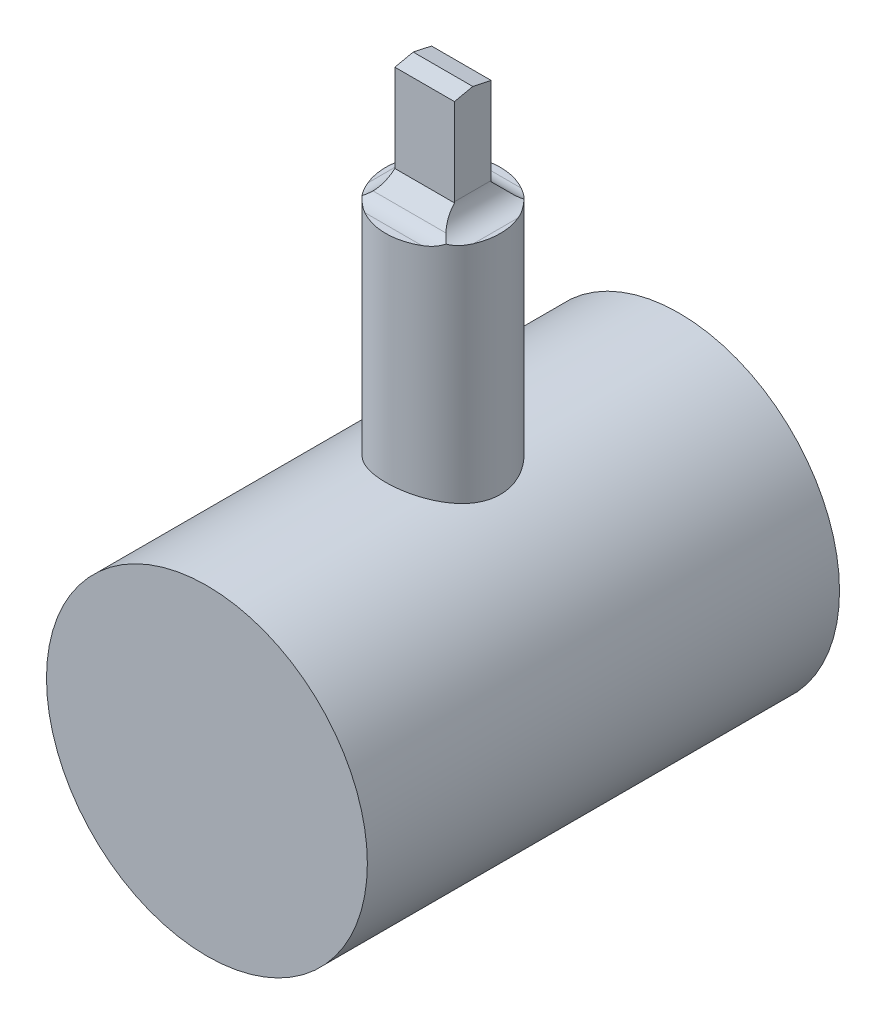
ISO-10303-21;
HEADER;
FILE_DESCRIPTION(('STEP AP214'),'2;1');
FILE_NAME('part.step','',(''),(''),'','','');
FILE_SCHEMA(('AUTOMOTIVE_DESIGN { 1 0 10303 214 1 1 1 1 }'));
ENDSEC;
DATA;
#1=APPLICATION_CONTEXT('core data for automotive mechanical design processes');
#2=APPLICATION_PROTOCOL_DEFINITION('international standard','automotive_design',2000,#1);
#3=PRODUCT_CONTEXT('',#1,'mechanical');
#4=PRODUCT('Part','Part','',(#3));
#5=PRODUCT_RELATED_PRODUCT_CATEGORY('part','',(#4));
#6=PRODUCT_DEFINITION_FORMATION('','',#4);
#7=PRODUCT_DEFINITION_CONTEXT('part definition',#1,'design');
#8=PRODUCT_DEFINITION('design','',#6,#7);
#9=PRODUCT_DEFINITION_SHAPE('','',#8);
#10=(LENGTH_UNIT() NAMED_UNIT(*) SI_UNIT(.MILLI.,.METRE.));
#11=(NAMED_UNIT(*) PLANE_ANGLE_UNIT() SI_UNIT($,.RADIAN.));
#12=(NAMED_UNIT(*) SI_UNIT($,.STERADIAN.) SOLID_ANGLE_UNIT());
#13=UNCERTAINTY_MEASURE_WITH_UNIT(LENGTH_MEASURE(1.E-05),#10,'distance_accuracy_value','');
#14=(GEOMETRIC_REPRESENTATION_CONTEXT(3) GLOBAL_UNCERTAINTY_ASSIGNED_CONTEXT((#13)) GLOBAL_UNIT_ASSIGNED_CONTEXT((#10,
#11,#12)) REPRESENTATION_CONTEXT('',''));
#15=CARTESIAN_POINT('',(0.,0.,0.));
#16=DIRECTION('',(0.,0.,1.));
#17=DIRECTION('',(1.,0.,0.));
#18=AXIS2_PLACEMENT_3D('',#15,#16,#17);
#19=CARTESIAN_POINT('',(-6.7818,10.417713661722,1.11388633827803));
#20=DIRECTION('',(0.,-1.,0.));
#21=DIRECTION('',(0.,0.,-1.));
#22=AXIS2_PLACEMENT_3D('',#19,#20,#21);
#23=PLANE('',#22);
#24=CARTESIAN_POINT('',(0.,10.417713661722,0.));
#25=DIRECTION('',(0.,-1.,0.));
#26=DIRECTION('',(0.,0.,-1.));
#27=AXIS2_PLACEMENT_3D('',#24,#25,#26);
#28=CIRCLE('',#27,1.5875);
#29=CARTESIAN_POINT('',(1.4605,10.417713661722,-0.622170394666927));
#30=VERTEX_POINT('',#29);
#31=CARTESIAN_POINT('',(1.4605,10.417713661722,0.622170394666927));
#32=VERTEX_POINT('',#31);
#33=EDGE_CURVE('E341',#30,#32,#28,.T.);
#34=ORIENTED_EDGE('',*,*,#33,.F.);
#35=DIRECTION('',(0.,0.,1.));
#36=VECTOR('',#35,1.);
#37=CARTESIAN_POINT('',(1.4605,10.417713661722,1.11388633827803));
#38=LINE('',#37,#36);
#39=EDGE_CURVE('E334',#30,#32,#38,.T.);
#40=ORIENTED_EDGE('',*,*,#39,.T.);
#41=EDGE_LOOP('',(#34,#40));
#42=FACE_BOUND('',#41,.T.);
#43=ADVANCED_FACE('F32',(#42),#23,.F.);
#44=CARTESIAN_POINT('',(-0.790107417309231,10.417713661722,-1.37691195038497));
#45=VERTEX_POINT('',#44);
#46=CARTESIAN_POINT('',(0.790107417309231,10.417713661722,-1.37691195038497));
#47=VERTEX_POINT('',#46);
#48=EDGE_CURVE('E194',#45,#47,#28,.T.);
#49=ORIENTED_EDGE('',*,*,#48,.F.);
#50=DIRECTION('',(1.,0.,0.));
#51=VECTOR('',#50,1.);
#52=CARTESIAN_POINT('',(0.8255,10.417713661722,-1.37691195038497));
#53=LINE('',#52,#51);
#54=EDGE_CURVE('E337',#45,#47,#53,.T.);
#55=ORIENTED_EDGE('',*,*,#54,.T.);
#56=EDGE_LOOP('',(#49,#55));
#57=FACE_BOUND('',#56,.T.);
#58=ADVANCED_FACE('F354',(#57),#23,.F.);
#59=CARTESIAN_POINT('',(0.790107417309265,10.417713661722,1.37691195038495));
#60=VERTEX_POINT('',#59);
#61=CARTESIAN_POINT('',(-0.790107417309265,10.417713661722,1.37691195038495));
#62=VERTEX_POINT('',#61);
#63=EDGE_CURVE('E342',#60,#62,#28,.T.);
#64=ORIENTED_EDGE('',*,*,#63,.F.);
#65=DIRECTION('',(1.,0.,0.));
#66=VECTOR('',#65,1.);
#67=CARTESIAN_POINT('',(-0.8255,10.417713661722,1.37691195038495));
#68=LINE('',#67,#66);
#69=EDGE_CURVE('E339',#60,#62,#68,.F.);
#70=ORIENTED_EDGE('',*,*,#69,.T.);
#71=EDGE_LOOP('',(#64,#70));
#72=FACE_BOUND('',#71,.T.);
#73=ADVANCED_FACE('F356',(#72),#23,.F.);
#74=CARTESIAN_POINT('',(0.,0.,6.5405));
#75=DIRECTION('',(0.,0.,-1.));
#76=DIRECTION('',(-1.,0.,0.));
#77=AXIS2_PLACEMENT_3D('',#74,#75,#76);
#78=CYLINDRICAL_SURFACE('',#77,4.445);
#79=CARTESIAN_POINT('',(0.,0.,-6.5405));
#80=DIRECTION('',(0.,0.,1.));
#81=DIRECTION('',(1.,0.,0.));
#82=AXIS2_PLACEMENT_3D('',#79,#80,#81);
#83=CIRCLE('',#82,4.445);
#84=CARTESIAN_POINT('',(4.445,0.,-6.5405));
#85=VERTEX_POINT('',#84);
#86=EDGE_CURVE('E171',#85,#85,#83,.T.);
#87=ORIENTED_EDGE('',*,*,#86,.T.);
#88=EDGE_LOOP('',(#87));
#89=FACE_BOUND('',#88,.T.);
#90=CARTESIAN_POINT('',(0.,0.,6.5405));
#91=DIRECTION('',(0.,0.,1.));
#92=DIRECTION('',(1.,0.,0.));
#93=AXIS2_PLACEMENT_3D('',#90,#91,#92);
#94=CIRCLE('',#93,4.445);
#95=CARTESIAN_POINT('',(4.445,0.,6.5405));
#96=VERTEX_POINT('',#95);
#97=EDGE_CURVE('E181',#96,#96,#94,.T.);
#98=ORIENTED_EDGE('',*,*,#97,.F.);
#99=EDGE_LOOP('',(#98));
#100=FACE_BOUND('',#99,.T.);
#101=CARTESIAN_POINT('',(0.,4.445,-1.5875));
#102=CARTESIAN_POINT('',(-0.0862582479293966,4.44500128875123,-1.58750179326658));
#103=CARTESIAN_POINT('',(-0.172503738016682,4.44246670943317,-1.58044720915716));
#104=CARTESIAN_POINT('',(-0.34243320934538,4.43260737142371,-1.55251703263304));
#105=CARTESIAN_POINT('',(-0.426117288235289,4.4252827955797,-1.53164196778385));
#106=CARTESIAN_POINT('',(-0.588449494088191,4.40663399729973,-1.47689243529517));
#107=CARTESIAN_POINT('',(-0.667106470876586,4.3953170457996,-1.44304158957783));
#108=CARTESIAN_POINT('',(-0.817623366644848,4.36982284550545,-1.36341566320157));
#109=CARTESIAN_POINT('',(-0.889481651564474,4.35564491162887,-1.31763772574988));
#110=CARTESIAN_POINT('',(-1.02716839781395,4.32528584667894,-1.21358461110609));
#111=CARTESIAN_POINT('',(-1.09269539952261,4.30905175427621,-1.15492610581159));
#112=CARTESIAN_POINT('',(-1.21321956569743,4.27668386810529,-1.02759105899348));
#113=CARTESIAN_POINT('',(-1.26821392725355,4.26055010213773,-0.958911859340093));
#114=CARTESIAN_POINT('',(-1.3679407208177,4.22960844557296,-0.810642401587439));
#115=CARTESIAN_POINT('',(-1.41226241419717,4.21486398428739,-0.730761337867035));
#116=CARTESIAN_POINT('',(-1.48671008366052,4.18918613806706,-0.564068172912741));
#117=CARTESIAN_POINT('',(-1.51684113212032,4.17825139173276,-0.477258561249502));
#118=CARTESIAN_POINT('',(-1.56088797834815,4.16199344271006,-0.302626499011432));
#119=CARTESIAN_POINT('',(-1.57537479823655,4.15647335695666,-0.214966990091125));
#120=CARTESIAN_POINT('',(-1.5895075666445,4.15109064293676,-0.0383008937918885));
#121=CARTESIAN_POINT('',(-1.58915893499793,4.15122594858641,0.050705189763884));
#122=CARTESIAN_POINT('',(-1.5740702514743,4.15696773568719,0.222475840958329));
#123=CARTESIAN_POINT('',(-1.56010077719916,4.1622812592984,0.305319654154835));
#124=CARTESIAN_POINT('',(-1.51943340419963,4.17729722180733,0.467399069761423));
#125=CARTESIAN_POINT('',(-1.4927337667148,4.18700026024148,0.546634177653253));
#126=CARTESIAN_POINT('',(-1.42690574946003,4.20989233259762,0.700896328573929));
#127=CARTESIAN_POINT('',(-1.38756514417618,4.22314019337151,0.775823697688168));
#128=CARTESIAN_POINT('',(-1.29771948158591,4.25160738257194,0.918245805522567));
#129=CARTESIAN_POINT('',(-1.24721083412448,4.26682734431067,0.985738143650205));
#130=CARTESIAN_POINT('',(-1.13285999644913,4.29864836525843,1.11566934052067));
#131=CARTESIAN_POINT('',(-1.06839595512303,4.31527726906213,1.17755534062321));
#132=CARTESIAN_POINT('',(-0.929806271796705,4.34724475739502,1.28979401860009));
#133=CARTESIAN_POINT('',(-0.855679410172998,4.36258317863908,1.34014523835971));
#134=CARTESIAN_POINT('',(-0.698563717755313,4.39049794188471,1.42842018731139));
#135=CARTESIAN_POINT('',(-0.615473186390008,4.40303622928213,1.46617578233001));
#136=CARTESIAN_POINT('',(-0.443562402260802,4.4236587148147,1.52699454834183));
#137=CARTESIAN_POINT('',(-0.354744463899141,4.43174469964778,1.55006361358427));
#138=CARTESIAN_POINT('',(-0.178565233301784,4.44224538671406,1.57982866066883));
#139=CARTESIAN_POINT('',(-0.0913451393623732,4.44491811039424,1.58727021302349));
#140=CARTESIAN_POINT('',(0.0831274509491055,4.44507809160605,1.58771915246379));
#141=CARTESIAN_POINT('',(0.170379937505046,4.4425663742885,1.58072939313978));
#142=CARTESIAN_POINT('',(0.339324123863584,4.43281022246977,1.5530918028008));
#143=CARTESIAN_POINT('',(0.421103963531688,4.42573040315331,1.53291873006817));
#144=CARTESIAN_POINT('',(0.580072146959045,4.40771436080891,1.4800982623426));
#145=CARTESIAN_POINT('',(0.657259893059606,4.39677763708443,1.44744924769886));
#146=CARTESIAN_POINT('',(0.807286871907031,4.37175744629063,1.36959412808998));
#147=CARTESIAN_POINT('',(0.879942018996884,4.35759391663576,1.3240597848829));
#148=CARTESIAN_POINT('',(1.0168123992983,4.32770531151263,1.22210354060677));
#149=CARTESIAN_POINT('',(1.08102472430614,4.31197970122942,1.16567790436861));
#150=CARTESIAN_POINT('',(1.20270455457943,4.27968436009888,1.04004768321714));
#151=CARTESIAN_POINT('',(1.25964113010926,4.26311364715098,0.970327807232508));
#152=CARTESIAN_POINT('',(1.36109408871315,4.23181701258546,0.821981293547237));
#153=CARTESIAN_POINT('',(1.40560986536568,4.21709118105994,0.743354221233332));
#154=CARTESIAN_POINT('',(1.48087515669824,4.19125611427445,0.579078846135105));
#155=CARTESIAN_POINT('',(1.51160994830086,4.1801507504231,0.493423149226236));
#156=CARTESIAN_POINT('',(1.55804501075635,4.16306915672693,0.317652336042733));
#157=CARTESIAN_POINT('',(1.573753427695,4.15709014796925,0.227539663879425));
#158=CARTESIAN_POINT('',(1.58900022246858,4.15128453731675,0.0511044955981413));
#159=CARTESIAN_POINT('',(1.58943311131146,4.15111759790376,-0.0351302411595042));
#160=CARTESIAN_POINT('',(1.57636867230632,4.15609607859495,-0.206373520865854));
#161=CARTESIAN_POINT('',(1.56287242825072,4.16124108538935,-0.291382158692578));
#162=CARTESIAN_POINT('',(1.52300309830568,4.17599304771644,-0.455612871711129));
#163=CARTESIAN_POINT('',(1.49696145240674,4.18548486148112,-0.534926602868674));
#164=CARTESIAN_POINT('',(1.43302129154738,4.20780419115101,-0.688113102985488));
#165=CARTESIAN_POINT('',(1.39511992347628,4.22063250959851,-0.761984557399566));
#166=CARTESIAN_POINT('',(1.30638748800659,4.24895791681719,-0.906097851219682));
#167=CARTESIAN_POINT('',(1.25501635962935,4.26455459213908,-0.975987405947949));
#168=CARTESIAN_POINT('',(1.14167198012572,4.29628561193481,-1.10644146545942));
#169=CARTESIAN_POINT('',(1.07969552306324,4.31242011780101,-1.16700313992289));
#170=CARTESIAN_POINT('',(0.943395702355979,4.34432357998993,-1.27998340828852));
#171=CARTESIAN_POINT('',(0.868627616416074,4.36003933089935,-1.33188268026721));
#172=CARTESIAN_POINT('',(0.710889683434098,4.38851626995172,-1.42234136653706));
#173=CARTESIAN_POINT('',(0.627920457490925,4.40127768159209,-1.46090179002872));
#174=CARTESIAN_POINT('',(0.455705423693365,4.42243213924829,-1.52345409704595));
#175=CARTESIAN_POINT('',(0.366434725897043,4.43080661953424,-1.54738413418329));
#176=CARTESIAN_POINT('',(0.184770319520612,4.4420887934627,-1.57940303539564));
#177=CARTESIAN_POINT('',(0.09237784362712,4.44499861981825,-1.58749807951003));
#178=CARTESIAN_POINT('',(0.,4.445,-1.5875));
#179=B_SPLINE_CURVE_WITH_KNOTS('',3,(#101,#102,#103,#104,#105,#106,#107,#108,#109,#110,#111,
#112,#113,#114,#115,#116,#117,#118,#119,#120,#121,#122,#123,#124,#125,#126,#127,#128,#129,#130,
#131,#132,#133,#134,#135,#136,#137,#138,#139,#140,#141,#142,#143,#144,#145,#146,#147,#148,#149,
#150,#151,#152,#153,#154,#155,#156,#157,#158,#159,#160,#161,#162,#163,#164,#165,#166,#167,#168,
#169,#170,#171,#172,#173,#174,#175,#176,#177,#178),.UNSPECIFIED.,.T.,.F.,(4,2,2,2,2,2,2,2,2,2,2,
2,2,2,2,2,2,2,2,2,2,2,2,2,2,2,2,2,2,2,2,2,2,2,2,2,2,2,4),(0.,0.258434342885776,
0.516858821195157,0.774815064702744,1.03283315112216,1.29993753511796,1.56711290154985,
1.84333900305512,2.11946629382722,2.3851334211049,2.65070349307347,2.90207221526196,
3.15347528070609,3.40934135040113,3.66528979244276,3.93672474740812,4.20819399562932,
4.48315413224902,4.75800384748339,5.01941166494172,5.28076779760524,5.53319522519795,
5.78565543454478,6.04523719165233,6.30490813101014,6.5782087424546,6.85152269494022,
7.12512795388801,7.39858480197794,7.65600011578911,7.91339540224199,8.16433522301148,
8.41533545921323,8.67856687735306,8.94187801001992,9.21761831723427,9.49333775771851,
9.77021481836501,10.046983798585),.UNSPECIFIED.);
#180=CARTESIAN_POINT('',(0.,4.445,-1.5875));
#181=VERTEX_POINT('',#180);
#182=EDGE_CURVE('E184',#181,#181,#179,.T.);
#183=ORIENTED_EDGE('',*,*,#182,.F.);
#184=EDGE_LOOP('',(#183));
#185=FACE_BOUND('',#184,.T.);
#186=ADVANCED_FACE('F196',(#89,#100,#185),#78,.T.);
#187=CARTESIAN_POINT('',(0.,0.,6.5405));
#188=DIRECTION('',(0.,0.,1.));
#189=DIRECTION('',(1.,0.,0.));
#190=AXIS2_PLACEMENT_3D('',#187,#188,#189);
#191=PLANE('',#190);
#192=ORIENTED_EDGE('',*,*,#97,.T.);
#193=EDGE_LOOP('',(#192));
#194=FACE_BOUND('',#193,.T.);
#195=ADVANCED_FACE('F209',(#194),#191,.T.);
#196=CARTESIAN_POINT('',(0.,0.,-6.5405));
#197=DIRECTION('',(0.,0.,1.));
#198=DIRECTION('',(1.,0.,0.));
#199=AXIS2_PLACEMENT_3D('',#196,#197,#198);
#200=PLANE('',#199);
#201=ORIENTED_EDGE('',*,*,#86,.F.);
#202=EDGE_LOOP('',(#201));
#203=FACE_BOUND('',#202,.T.);
#204=ADVANCED_FACE('F205',(#203),#200,.F.);
#205=CARTESIAN_POINT('',(0.,13.5636,0.));
#206=DIRECTION('',(0.,-1.,0.));
#207=DIRECTION('',(0.,0.,-1.));
#208=AXIS2_PLACEMENT_3D('',#205,#206,#207);
#209=CYLINDRICAL_SURFACE('',#208,1.5875);
#210=ORIENTED_EDGE('',*,*,#48,.T.);
#211=CARTESIAN_POINT('',(0.790107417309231,10.417713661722,-1.37691195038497));
#212=CARTESIAN_POINT('',(0.813546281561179,10.4177180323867,-1.36346117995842));
#213=CARTESIAN_POINT('',(0.836635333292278,10.4181414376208,-1.34941612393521));
#214=CARTESIAN_POINT('',(0.88207307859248,10.4200829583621,-1.32016556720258));
#215=CARTESIAN_POINT('',(0.904420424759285,10.421602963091,-1.30495810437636));
#216=CARTESIAN_POINT('',(0.96925911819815,10.4281014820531,-1.2583610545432));
#217=CARTESIAN_POINT('',(1.01052741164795,10.4349985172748,-1.22543237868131));
#218=CARTESIAN_POINT('',(1.06976923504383,10.4509761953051,-1.17323565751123));
#219=CARTESIAN_POINT('',(1.08940066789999,10.4574113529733,-1.15501416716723));
#220=CARTESIAN_POINT('',(1.12747537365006,10.4725949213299,-1.11788833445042));
#221=CARTESIAN_POINT('',(1.14590453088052,10.4813661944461,-1.09897893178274));
#222=CARTESIAN_POINT('',(1.16354773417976,10.4914255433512,-1.07995968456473));
#223=B_SPLINE_CURVE_WITH_KNOTS('',3,(#211,#212,#213,#214,#215,#216,#217,#218,#219,#220,#221,
#222),.UNSPECIFIED.,.F.,.F.,(4,2,2,2,2,4),(0.,0.0810400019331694,0.162219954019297,
0.321211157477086,0.403737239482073,0.487102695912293),.UNSPECIFIED.);
#224=CARTESIAN_POINT('',(1.16354773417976,10.4914255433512,-1.07995968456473));
#225=VERTEX_POINT('',#224);
#226=EDGE_CURVE('E233',#47,#225,#223,.T.);
#227=ORIENTED_EDGE('',*,*,#226,.T.);
#228=CARTESIAN_POINT('',(1.16354773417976,10.4914255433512,-1.07995968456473));
#229=CARTESIAN_POINT('',(1.18099122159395,10.48220141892,-1.06117481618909));
#230=CARTESIAN_POINT('',(1.1982249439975,10.4741186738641,-1.0416850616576));
#231=CARTESIAN_POINT('',(1.23201637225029,10.4599607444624,-1.00148702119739));
#232=CARTESIAN_POINT('',(1.24857516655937,10.4538822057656,-0.980780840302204));
#233=CARTESIAN_POINT('',(1.29641225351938,10.4383735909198,-0.917724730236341));
#234=CARTESIAN_POINT('',(1.32643909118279,10.4313871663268,-0.873808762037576));
#235=CARTESIAN_POINT('',(1.37426699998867,10.423267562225,-0.795630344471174));
#236=CARTESIAN_POINT('',(1.39313877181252,10.4210438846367,-0.762102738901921));
#237=CARTESIAN_POINT('',(1.42863675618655,10.4182655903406,-0.693303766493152));
#238=CARTESIAN_POINT('',(1.44523381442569,10.4177309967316,-0.658016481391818));
#239=CARTESIAN_POINT('',(1.4605,10.417713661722,-0.622170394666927));
#240=B_SPLINE_CURVE_WITH_KNOTS('',3,(#228,#229,#230,#231,#232,#233,#234,#235,#236,#237,#238,
#239),.UNSPECIFIED.,.F.,.F.,(4,2,2,2,2,4),(0.,0.0816434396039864,0.163149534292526,
0.323477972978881,0.438970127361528,0.555826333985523),.UNSPECIFIED.);
#241=EDGE_CURVE('E225',#225,#30,#240,.T.);
#242=ORIENTED_EDGE('',*,*,#241,.T.);
#243=ORIENTED_EDGE('',*,*,#33,.T.);
#244=CARTESIAN_POINT('',(1.4605,10.417713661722,0.622170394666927));
#245=CARTESIAN_POINT('',(1.44598997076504,10.4177269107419,0.656250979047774));
#246=CARTESIAN_POINT('',(1.4302636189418,10.4182123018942,0.689840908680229));
#247=CARTESIAN_POINT('',(1.39646726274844,10.4207185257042,0.755917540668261));
#248=CARTESIAN_POINT('',(1.37838859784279,10.4227451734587,0.788399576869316));
#249=CARTESIAN_POINT('',(1.34059167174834,10.4288526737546,0.851043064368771));
#250=CARTESIAN_POINT('',(1.32092891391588,10.432878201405,0.881243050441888));
#251=CARTESIAN_POINT('',(1.27986494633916,10.44357880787,0.939881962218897));
#252=CARTESIAN_POINT('',(1.25846732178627,10.4502485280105,0.96832431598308));
#253=CARTESIAN_POINT('',(1.22462317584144,10.4630142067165,1.01035043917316));
#254=CARTESIAN_POINT('',(1.21265210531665,10.4679291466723,1.02468183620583));
#255=CARTESIAN_POINT('',(1.18833781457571,10.478839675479,1.05278595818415));
#256=CARTESIAN_POINT('',(1.17599259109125,10.4848425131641,1.06655412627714));
#257=CARTESIAN_POINT('',(1.16354773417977,10.4914255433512,1.07995968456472));
#258=B_SPLINE_CURVE_WITH_KNOTS('',3,(#244,#245,#246,#247,#248,#249,#250,#251,#252,#253,#254,
#255,#256,#257),.UNSPECIFIED.,.F.,.F.,(4,2,2,2,2,2,4),(0.,0.111136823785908,0.222695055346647,
0.331324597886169,0.439735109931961,0.497625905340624,0.555917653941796),.UNSPECIFIED.);
#259=CARTESIAN_POINT('',(1.16354773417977,10.4914255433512,1.07995968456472));
#260=VERTEX_POINT('',#259);
#261=EDGE_CURVE('E216',#32,#260,#258,.T.);
#262=ORIENTED_EDGE('',*,*,#261,.T.);
#263=CARTESIAN_POINT('',(1.16354773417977,10.4914255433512,1.07995968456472));
#264=CARTESIAN_POINT('',(1.14620557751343,10.4815379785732,1.09865374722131));
#265=CARTESIAN_POINT('',(1.12810408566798,10.4728947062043,1.11724259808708));
#266=CARTESIAN_POINT('',(1.09057086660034,10.4578315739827,1.15390391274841));
#267=CARTESIAN_POINT('',(1.07114163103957,10.4514076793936,1.17197725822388));
#268=CARTESIAN_POINT('',(1.01174854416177,10.4352141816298,1.22444722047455));
#269=CARTESIAN_POINT('',(0.970059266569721,10.4281967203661,1.25776819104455));
#270=CARTESIAN_POINT('',(0.904825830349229,10.4216360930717,1.30467569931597));
#271=CARTESIAN_POINT('',(0.882542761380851,10.4201119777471,1.31985024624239));
#272=CARTESIAN_POINT('',(0.836998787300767,10.4181482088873,1.3491948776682));
#273=CARTESIAN_POINT('',(0.813731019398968,10.417718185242,1.3633549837));
#274=CARTESIAN_POINT('',(0.790107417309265,10.417713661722,1.37691195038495));
#275=B_SPLINE_CURVE_WITH_KNOTS('',3,(#263,#264,#265,#266,#267,#268,#269,#270,#271,#272,#273,
#274),.UNSPECIFIED.,.F.,.F.,(4,2,2,2,2,4),(0.,0.0819448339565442,0.163739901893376,
0.324455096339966,0.405422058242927,0.487099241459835),.UNSPECIFIED.);
#276=EDGE_CURVE('E247',#260,#60,#275,.T.);
#277=ORIENTED_EDGE('',*,*,#276,.T.);
#278=ORIENTED_EDGE('',*,*,#63,.T.);
#279=CARTESIAN_POINT('',(-0.790107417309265,10.417713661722,1.37691195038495));
#280=CARTESIAN_POINT('',(-0.813546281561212,10.4177180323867,1.3634611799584));
#281=CARTESIAN_POINT('',(-0.836635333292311,10.4181414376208,1.34941612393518));
#282=CARTESIAN_POINT('',(-0.882073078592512,10.4200829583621,1.32016556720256));
#283=CARTESIAN_POINT('',(-0.904420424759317,10.421602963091,1.30495810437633));
#284=CARTESIAN_POINT('',(-0.969259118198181,10.4281014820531,1.25836105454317));
#285=CARTESIAN_POINT('',(-1.01052741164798,10.4349985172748,1.22543237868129));
#286=CARTESIAN_POINT('',(-1.06976923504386,10.4509761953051,1.17323565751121));
#287=CARTESIAN_POINT('',(-1.08940066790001,10.4574113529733,1.15501416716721));
#288=CARTESIAN_POINT('',(-1.12747537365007,10.4725949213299,1.1178883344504));
#289=CARTESIAN_POINT('',(-1.14590453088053,10.4813661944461,1.09897893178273));
#290=CARTESIAN_POINT('',(-1.16354773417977,10.4914255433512,1.07995968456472));
#291=B_SPLINE_CURVE_WITH_KNOTS('',3,(#279,#280,#281,#282,#283,#284,#285,#286,#287,#288,#289,
#290),.UNSPECIFIED.,.F.,.F.,(4,2,2,2,2,4),(0.,0.0810400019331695,0.162219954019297,
0.321211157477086,0.40373723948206,0.487102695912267),.UNSPECIFIED.);
#292=CARTESIAN_POINT('',(-1.16354773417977,10.4914255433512,1.07995968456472));
#293=VERTEX_POINT('',#292);
#294=EDGE_CURVE('E254',#62,#293,#291,.T.);
#295=ORIENTED_EDGE('',*,*,#294,.T.);
#296=CARTESIAN_POINT('',(-1.16354773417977,10.4914255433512,1.07995968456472));
#297=CARTESIAN_POINT('',(-1.18099122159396,10.48220141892,1.06117481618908));
#298=CARTESIAN_POINT('',(-1.19822494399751,10.4741186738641,1.04168506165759));
#299=CARTESIAN_POINT('',(-1.2320163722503,10.4599607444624,1.00148702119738));
#300=CARTESIAN_POINT('',(-1.24857516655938,10.4538822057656,0.980780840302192));
#301=CARTESIAN_POINT('',(-1.29641225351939,10.4383735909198,0.917724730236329));
#302=CARTESIAN_POINT('',(-1.3264390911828,10.4313871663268,0.873808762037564));
#303=CARTESIAN_POINT('',(-1.37426699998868,10.423267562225,0.795630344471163));
#304=CARTESIAN_POINT('',(-1.39313877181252,10.4210438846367,0.762102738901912));
#305=CARTESIAN_POINT('',(-1.42863675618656,10.4182655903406,0.693303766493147));
#306=CARTESIAN_POINT('',(-1.44523381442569,10.4177309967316,0.658016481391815));
#307=CARTESIAN_POINT('',(-1.4605,10.417713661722,0.622170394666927));
#308=B_SPLINE_CURVE_WITH_KNOTS('',3,(#296,#297,#298,#299,#300,#301,#302,#303,#304,#305,#306,
#307),.UNSPECIFIED.,.F.,.F.,(4,2,2,2,2,4),(0.,0.0816434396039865,0.163149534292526,
0.323477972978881,0.43897012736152,0.555826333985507),.UNSPECIFIED.);
#309=CARTESIAN_POINT('',(-1.4605,10.417713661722,0.622170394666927));
#310=VERTEX_POINT('',#309);
#311=EDGE_CURVE('E261',#293,#310,#308,.T.);
#312=ORIENTED_EDGE('',*,*,#311,.T.);
#313=CARTESIAN_POINT('',(-1.4605,10.417713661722,-0.622170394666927));
#314=VERTEX_POINT('',#313);
#315=EDGE_CURVE('E343',#310,#314,#28,.T.);
#316=ORIENTED_EDGE('',*,*,#315,.T.);
#317=CARTESIAN_POINT('',(-1.4605,10.417713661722,-0.622170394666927));
#318=CARTESIAN_POINT('',(-1.44598997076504,10.4177269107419,-0.656250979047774));
#319=CARTESIAN_POINT('',(-1.4302636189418,10.4182123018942,-0.689840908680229));
#320=CARTESIAN_POINT('',(-1.39646726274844,10.4207185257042,-0.755917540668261));
#321=CARTESIAN_POINT('',(-1.37838859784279,10.4227451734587,-0.788399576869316));
#322=CARTESIAN_POINT('',(-1.34059167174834,10.4288526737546,-0.851043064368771));
#323=CARTESIAN_POINT('',(-1.32092891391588,10.432878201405,-0.881243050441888));
#324=CARTESIAN_POINT('',(-1.27986494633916,10.44357880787,-0.939881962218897));
#325=CARTESIAN_POINT('',(-1.25846732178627,10.4502485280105,-0.96832431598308));
#326=CARTESIAN_POINT('',(-1.22462317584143,10.4630142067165,-1.01035043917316));
#327=CARTESIAN_POINT('',(-1.21265210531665,10.4679291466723,-1.02468183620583));
#328=CARTESIAN_POINT('',(-1.1883378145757,10.478839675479,-1.05278595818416));
#329=CARTESIAN_POINT('',(-1.17599259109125,10.4848425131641,-1.06655412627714));
#330=CARTESIAN_POINT('',(-1.16354773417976,10.4914255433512,-1.07995968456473));
#331=B_SPLINE_CURVE_WITH_KNOTS('',3,(#317,#318,#319,#320,#321,#322,#323,#324,#325,#326,#327,
#328,#329,#330),.UNSPECIFIED.,.F.,.F.,(4,2,2,2,2,2,4),(0.,0.111136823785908,0.222695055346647,
0.331324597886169,0.439735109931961,0.497625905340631,0.55591765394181),.UNSPECIFIED.);
#332=CARTESIAN_POINT('',(-1.16354773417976,10.4914255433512,-1.07995968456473));
#333=VERTEX_POINT('',#332);
#334=EDGE_CURVE('E267',#314,#333,#331,.T.);
#335=ORIENTED_EDGE('',*,*,#334,.T.);
#336=CARTESIAN_POINT('',(-1.16354773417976,10.4914255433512,-1.07995968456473));
#337=CARTESIAN_POINT('',(-1.14620557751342,10.4815379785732,-1.09865374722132));
#338=CARTESIAN_POINT('',(-1.12810408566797,10.4728947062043,-1.11724259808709));
#339=CARTESIAN_POINT('',(-1.09057086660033,10.4578315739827,-1.15390391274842));
#340=CARTESIAN_POINT('',(-1.07114163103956,10.4514076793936,-1.17197725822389));
#341=CARTESIAN_POINT('',(-1.01174854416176,10.4352141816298,-1.22444722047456));
#342=CARTESIAN_POINT('',(-0.970059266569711,10.4281967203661,-1.25776819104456));
#343=CARTESIAN_POINT('',(-0.904825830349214,10.4216360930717,-1.30467569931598));
#344=CARTESIAN_POINT('',(-0.882542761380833,10.4201119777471,-1.3198502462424));
#345=CARTESIAN_POINT('',(-0.836998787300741,10.4181482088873,-1.34919487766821));
#346=CARTESIAN_POINT('',(-0.813731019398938,10.417718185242,-1.36335498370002));
#347=CARTESIAN_POINT('',(-0.790107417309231,10.417713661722,-1.37691195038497));
#348=B_SPLINE_CURVE_WITH_KNOTS('',3,(#336,#337,#338,#339,#340,#341,#342,#343,#344,#345,#346,
#347),.UNSPECIFIED.,.F.,.F.,(4,2,2,2,2,4),(0.,0.0819448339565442,0.163739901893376,
0.324455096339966,0.40542205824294,0.487099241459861),.UNSPECIFIED.);
#349=EDGE_CURVE('E240',#333,#45,#348,.T.);
#350=ORIENTED_EDGE('',*,*,#349,.T.);
#351=EDGE_LOOP('',(#210,#227,#242,#243,#262,#277,#278,#295,#312,#316,#335,#350));
#352=FACE_BOUND('',#351,.T.);
#353=ORIENTED_EDGE('',*,*,#182,.T.);
#354=EDGE_LOOP('',(#353));
#355=FACE_BOUND('',#354,.T.);
#356=ADVANCED_FACE('F200',(#352,#355),#209,.T.);
#357=CARTESIAN_POINT('',(-6.7818,13.4549652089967,0.508));
#358=DIRECTION('',(0.,0.,-1.));
#359=DIRECTION('',(0.,1.,0.));
#360=AXIS2_PLACEMENT_3D('',#357,#358,#359);
#361=PLANE('',#360);
#362=DIRECTION('',(1.,0.,0.));
#363=VECTOR('',#362,1.);
#364=CARTESIAN_POINT('',(-6.7818,11.0236,0.508));
#365=LINE('',#364,#363);
#366=CARTESIAN_POINT('',(-0.826167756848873,11.0236,0.508));
#367=VERTEX_POINT('',#366);
#368=CARTESIAN_POINT('',(0.826167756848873,11.0236,0.508));
#369=VERTEX_POINT('',#368);
#370=EDGE_CURVE('E57',#367,#369,#365,.T.);
#371=ORIENTED_EDGE('',*,*,#370,.T.);
#372=CARTESIAN_POINT('',(1.4605,11.052713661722,0.508));
#373=DIRECTION('',(0.,0.,-1.));
#374=DIRECTION('',(0.,1.,0.));
#375=AXIS2_PLACEMENT_3D('',#372,#373,#374);
#376=CIRCLE('',#375,0.635);
#377=CARTESIAN_POINT('',(0.8255,11.052713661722,0.508));
#378=VERTEX_POINT('',#377);
#379=EDGE_CURVE('E149',#369,#378,#376,.T.);
#380=ORIENTED_EDGE('',*,*,#379,.T.);
#381=DIRECTION('',(0.,1.,0.));
#382=VECTOR('',#381,1.);
#383=CARTESIAN_POINT('',(0.825500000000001,13.4549652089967,0.508));
#384=LINE('',#383,#382);
#385=CARTESIAN_POINT('',(0.825500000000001,13.4549652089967,0.508));
#386=VERTEX_POINT('',#385);
#387=EDGE_CURVE('E142',#378,#386,#384,.T.);
#388=ORIENTED_EDGE('',*,*,#387,.T.);
#389=DIRECTION('',(1.,0.,0.));
#390=VECTOR('',#389,1.);
#391=CARTESIAN_POINT('',(-6.7818,13.4549652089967,0.508));
#392=LINE('',#391,#390);
#393=CARTESIAN_POINT('',(-0.825500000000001,13.4549652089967,0.508));
#394=VERTEX_POINT('',#393);
#395=EDGE_CURVE('E147',#394,#386,#392,.T.);
#396=ORIENTED_EDGE('',*,*,#395,.F.);
#397=DIRECTION('',(0.,-1.,0.));
#398=VECTOR('',#397,1.);
#399=CARTESIAN_POINT('',(-0.825500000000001,13.4549652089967,0.508));
#400=LINE('',#399,#398);
#401=CARTESIAN_POINT('',(-0.8255,11.052713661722,0.508));
#402=VERTEX_POINT('',#401);
#403=EDGE_CURVE('E180',#394,#402,#400,.T.);
#404=ORIENTED_EDGE('',*,*,#403,.T.);
#405=CARTESIAN_POINT('',(-1.4605,11.052713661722,0.508));
#406=DIRECTION('',(0.,0.,-1.));
#407=DIRECTION('',(0.,1.,0.));
#408=AXIS2_PLACEMENT_3D('',#405,#406,#407);
#409=CIRCLE('',#408,0.635);
#410=EDGE_CURVE('E299',#402,#367,#409,.T.);
#411=ORIENTED_EDGE('',*,*,#410,.T.);
#412=EDGE_LOOP('',(#371,#380,#388,#396,#404,#411));
#413=FACE_BOUND('',#412,.T.);
#414=ADVANCED_FACE('F144',(#413),#361,.F.);
#415=CARTESIAN_POINT('',(-6.7818,11.0236,0.508));
#416=DIRECTION('',(0.,-0.707106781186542,-0.707106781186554));
#417=DIRECTION('',(0.,0.707106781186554,-0.707106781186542));
#418=AXIS2_PLACEMENT_3D('',#415,#416,#417);
#419=PLANE('',#418);
#420=ORIENTED_EDGE('',*,*,#370,.F.);
#421=CARTESIAN_POINT('',(-1.4605,11.052713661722,0.478886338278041));
#422=DIRECTION('',(0.,-0.707106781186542,-0.707106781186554));
#423=DIRECTION('',(0.,0.707106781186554,-0.707106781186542));
#424=AXIS2_PLACEMENT_3D('',#421,#422,#423);
#425=ELLIPSE('',#424,0.898025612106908,0.635);
#426=CARTESIAN_POINT('',(-1.01148719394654,10.6037008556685,0.927899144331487));
#427=VERTEX_POINT('',#426);
#428=EDGE_CURVE('E268',#367,#427,#425,.T.);
#429=ORIENTED_EDGE('',*,*,#428,.T.);
#430=DIRECTION('',(1.,0.,0.));
#431=VECTOR('',#430,1.);
#432=CARTESIAN_POINT('',(0.8255,10.6037008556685,0.927899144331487));
#433=LINE('',#432,#431);
#434=CARTESIAN_POINT('',(1.01148719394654,10.6037008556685,0.927899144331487));
#435=VERTEX_POINT('',#434);
#436=EDGE_CURVE('E326',#427,#435,#433,.T.);
#437=ORIENTED_EDGE('',*,*,#436,.T.);
#438=CARTESIAN_POINT('',(1.4605,11.052713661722,0.478886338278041));
#439=DIRECTION('',(0.,-0.707106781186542,-0.707106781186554));
#440=DIRECTION('',(0.,0.707106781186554,-0.707106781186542));
#441=AXIS2_PLACEMENT_3D('',#438,#439,#440);
#442=ELLIPSE('',#441,0.898025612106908,0.635);
#443=EDGE_CURVE('E324',#435,#369,#442,.T.);
#444=ORIENTED_EDGE('',*,*,#443,.T.);
#445=EDGE_LOOP('',(#420,#429,#437,#444));
#446=FACE_BOUND('',#445,.T.);
#447=ADVANCED_FACE('F369',(#446),#419,.F.);
#448=ORIENTED_EDGE('',*,*,#315,.F.);
#449=DIRECTION('',(0.,0.,1.));
#450=VECTOR('',#449,1.);
#451=CARTESIAN_POINT('',(-1.4605,10.417713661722,-1.11388633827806));
#452=LINE('',#451,#450);
#453=EDGE_CURVE('E164',#310,#314,#452,.F.);
#454=ORIENTED_EDGE('',*,*,#453,.T.);
#455=EDGE_LOOP('',(#448,#454));
#456=FACE_BOUND('',#455,.T.);
#457=ADVANCED_FACE('F363',(#456),#23,.F.);
#458=CARTESIAN_POINT('',(-6.7818,11.0236,-0.508));
#459=DIRECTION('',(0.,-0.707106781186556,0.707106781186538));
#460=DIRECTION('',(0.,-0.707106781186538,-0.707106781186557));
#461=AXIS2_PLACEMENT_3D('',#458,#459,#460);
#462=PLANE('',#461);
#463=CARTESIAN_POINT('',(1.4605,11.052713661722,-0.478886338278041));
#464=DIRECTION('',(0.,-0.707106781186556,0.707106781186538));
#465=DIRECTION('',(0.,-0.707106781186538,-0.707106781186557));
#466=AXIS2_PLACEMENT_3D('',#463,#464,#465);
#467=ELLIPSE('',#466,0.898025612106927,0.635);
#468=CARTESIAN_POINT('',(0.826167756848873,11.0236,-0.508));
#469=VERTEX_POINT('',#468);
#470=CARTESIAN_POINT('',(1.01148719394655,10.6037008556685,-0.927899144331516));
#471=VERTEX_POINT('',#470);
#472=EDGE_CURVE('E314',#469,#471,#467,.T.);
#473=ORIENTED_EDGE('',*,*,#472,.T.);
#474=DIRECTION('',(1.,0.,0.));
#475=VECTOR('',#474,1.);
#476=CARTESIAN_POINT('',(-0.8255,10.6037008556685,-0.927899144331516));
#477=LINE('',#476,#475);
#478=CARTESIAN_POINT('',(-1.01148719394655,10.6037008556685,-0.927899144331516));
#479=VERTEX_POINT('',#478);
#480=EDGE_CURVE('E328',#471,#479,#477,.F.);
#481=ORIENTED_EDGE('',*,*,#480,.T.);
#482=CARTESIAN_POINT('',(-1.4605,11.052713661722,-0.478886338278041));
#483=DIRECTION('',(0.,-0.707106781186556,0.707106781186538));
#484=DIRECTION('',(0.,-0.707106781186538,-0.707106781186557));
#485=AXIS2_PLACEMENT_3D('',#482,#483,#484);
#486=ELLIPSE('',#485,0.898025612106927,0.635);
#487=CARTESIAN_POINT('',(-0.826167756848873,11.0236,-0.508));
#488=VERTEX_POINT('',#487);
#489=EDGE_CURVE('E42',#479,#488,#486,.T.);
#490=ORIENTED_EDGE('',*,*,#489,.T.);
#491=DIRECTION('',(1.,0.,0.));
#492=VECTOR('',#491,1.);
#493=CARTESIAN_POINT('',(-6.7818,11.0236,-0.508));
#494=LINE('',#493,#492);
#495=EDGE_CURVE('E49',#488,#469,#494,.T.);
#496=ORIENTED_EDGE('',*,*,#495,.T.);
#497=EDGE_LOOP('',(#473,#481,#490,#496));
#498=FACE_BOUND('',#497,.T.);
#499=ADVANCED_FACE('F368',(#498),#462,.F.);
#500=CARTESIAN_POINT('',(-6.7818,13.4549652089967,-0.508));
#501=DIRECTION('',(0.,0.,1.));
#502=DIRECTION('',(0.,-1.,0.));
#503=AXIS2_PLACEMENT_3D('',#500,#501,#502);
#504=PLANE('',#503);
#505=DIRECTION('',(1.,0.,0.));
#506=VECTOR('',#505,1.);
#507=CARTESIAN_POINT('',(-6.7818,13.4549652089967,-0.508));
#508=LINE('',#507,#506);
#509=CARTESIAN_POINT('',(-0.825500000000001,13.4549652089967,-0.508));
#510=VERTEX_POINT('',#509);
#511=CARTESIAN_POINT('',(0.825500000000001,13.4549652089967,-0.508));
#512=VERTEX_POINT('',#511);
#513=EDGE_CURVE('E177',#510,#512,#508,.T.);
#514=ORIENTED_EDGE('',*,*,#513,.T.);
#515=DIRECTION('',(0.,-1.,0.));
#516=VECTOR('',#515,1.);
#517=CARTESIAN_POINT('',(0.825500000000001,13.4549652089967,-0.508));
#518=LINE('',#517,#516);
#519=CARTESIAN_POINT('',(0.8255,11.052713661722,-0.508));
#520=VERTEX_POINT('',#519);
#521=EDGE_CURVE('E154',#512,#520,#518,.T.);
#522=ORIENTED_EDGE('',*,*,#521,.T.);
#523=CARTESIAN_POINT('',(1.4605,11.052713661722,-0.508));
#524=DIRECTION('',(0.,0.,1.));
#525=DIRECTION('',(0.,-1.,0.));
#526=AXIS2_PLACEMENT_3D('',#523,#524,#525);
#527=CIRCLE('',#526,0.635);
#528=EDGE_CURVE('E319',#520,#469,#527,.T.);
#529=ORIENTED_EDGE('',*,*,#528,.T.);
#530=ORIENTED_EDGE('',*,*,#495,.F.);
#531=CARTESIAN_POINT('',(-1.4605,11.052713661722,-0.508));
#532=DIRECTION('',(0.,0.,1.));
#533=DIRECTION('',(0.,-1.,0.));
#534=AXIS2_PLACEMENT_3D('',#531,#532,#533);
#535=CIRCLE('',#534,0.635);
#536=CARTESIAN_POINT('',(-0.8255,11.052713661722,-0.508));
#537=VERTEX_POINT('',#536);
#538=EDGE_CURVE('E11',#488,#537,#535,.T.);
#539=ORIENTED_EDGE('',*,*,#538,.T.);
#540=DIRECTION('',(0.,1.,0.));
#541=VECTOR('',#540,1.);
#542=CARTESIAN_POINT('',(-0.825500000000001,13.4549652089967,-0.508));
#543=LINE('',#542,#541);
#544=EDGE_CURVE('E297',#537,#510,#543,.T.);
#545=ORIENTED_EDGE('',*,*,#544,.T.);
#546=EDGE_LOOP('',(#514,#522,#529,#530,#539,#545));
#547=FACE_BOUND('',#546,.T.);
#548=ADVANCED_FACE('F372',(#547),#504,.F.);
#549=CARTESIAN_POINT('',(-6.7818,13.5636,0.));
#550=DIRECTION('',(0.,-0.977890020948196,0.209119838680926));
#551=DIRECTION('',(0.,-0.209119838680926,-0.977890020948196));
#552=AXIS2_PLACEMENT_3D('',#549,#550,#551);
#553=PLANE('',#552);
#554=DIRECTION('',(1.,0.,0.));
#555=VECTOR('',#554,1.);
#556=CARTESIAN_POINT('',(-6.7818,13.5636,0.));
#557=LINE('',#556,#555);
#558=CARTESIAN_POINT('',(-0.8255,13.5636,0.));
#559=VERTEX_POINT('',#558);
#560=CARTESIAN_POINT('',(0.825500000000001,13.5636,0.));
#561=VERTEX_POINT('',#560);
#562=EDGE_CURVE('E169',#559,#561,#557,.T.);
#563=ORIENTED_EDGE('',*,*,#562,.T.);
#564=DIRECTION('',(0.,-0.209119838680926,-0.977890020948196));
#565=VECTOR('',#564,1.);
#566=CARTESIAN_POINT('',(0.825500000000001,13.5636,0.));
#567=LINE('',#566,#565);
#568=EDGE_CURVE('E160',#561,#512,#567,.T.);
#569=ORIENTED_EDGE('',*,*,#568,.T.);
#570=ORIENTED_EDGE('',*,*,#513,.F.);
#571=DIRECTION('',(0.,0.209119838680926,0.977890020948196));
#572=VECTOR('',#571,1.);
#573=CARTESIAN_POINT('',(-0.825500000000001,13.5636,0.));
#574=LINE('',#573,#572);
#575=EDGE_CURVE('E153',#510,#559,#574,.T.);
#576=ORIENTED_EDGE('',*,*,#575,.T.);
#577=EDGE_LOOP('',(#563,#569,#570,#576));
#578=FACE_BOUND('',#577,.T.);
#579=ADVANCED_FACE('F207',(#578),#553,.F.);
#580=CARTESIAN_POINT('',(-6.7818,13.5636,0.));
#581=DIRECTION('',(0.,-0.977890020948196,-0.209119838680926));
#582=DIRECTION('',(0.,0.209119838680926,-0.977890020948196));
#583=AXIS2_PLACEMENT_3D('',#580,#581,#582);
#584=PLANE('',#583);
#585=ORIENTED_EDGE('',*,*,#395,.T.);
#586=DIRECTION('',(0.,0.209119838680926,-0.977890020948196));
#587=VECTOR('',#586,1.);
#588=CARTESIAN_POINT('',(0.825500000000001,13.5636,0.));
#589=LINE('',#588,#587);
#590=EDGE_CURVE('E157',#386,#561,#589,.T.);
#591=ORIENTED_EDGE('',*,*,#590,.T.);
#592=ORIENTED_EDGE('',*,*,#562,.F.);
#593=DIRECTION('',(0.,-0.209119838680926,0.977890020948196));
#594=VECTOR('',#593,1.);
#595=CARTESIAN_POINT('',(-0.825500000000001,13.5636,0.));
#596=LINE('',#595,#594);
#597=EDGE_CURVE('E165',#559,#394,#596,.T.);
#598=ORIENTED_EDGE('',*,*,#597,.T.);
#599=EDGE_LOOP('',(#585,#591,#592,#598));
#600=FACE_BOUND('',#599,.T.);
#601=ADVANCED_FACE('F168',(#600),#584,.F.);
#602=CARTESIAN_POINT('',(-0.8255,13.5636,-6.7818));
#603=DIRECTION('',(1.,0.,0.));
#604=DIRECTION('',(0.,1.,0.));
#605=AXIS2_PLACEMENT_3D('',#602,#603,#604);
#606=PLANE('',#605);
#607=ORIENTED_EDGE('',*,*,#544,.F.);
#608=DIRECTION('',(0.,0.,1.));
#609=VECTOR('',#608,1.);
#610=CARTESIAN_POINT('',(-0.8255,11.052713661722,1.11388633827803));
#611=LINE('',#610,#609);
#612=EDGE_CURVE('E305',#537,#402,#611,.T.);
#613=ORIENTED_EDGE('',*,*,#612,.T.);
#614=ORIENTED_EDGE('',*,*,#403,.F.);
#615=ORIENTED_EDGE('',*,*,#597,.F.);
#616=ORIENTED_EDGE('',*,*,#575,.F.);
#617=EDGE_LOOP('',(#607,#613,#614,#615,#616));
#618=FACE_BOUND('',#617,.T.);
#619=ADVANCED_FACE('F378',(#618),#606,.F.);
#620=CARTESIAN_POINT('',(0.8255,13.5636,-6.7818));
#621=DIRECTION('',(-1.,0.,0.));
#622=DIRECTION('',(0.,-1.,0.));
#623=AXIS2_PLACEMENT_3D('',#620,#621,#622);
#624=PLANE('',#623);
#625=ORIENTED_EDGE('',*,*,#387,.F.);
#626=DIRECTION('',(0.,0.,1.));
#627=VECTOR('',#626,1.);
#628=CARTESIAN_POINT('',(0.8255,11.052713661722,-1.11388633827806));
#629=LINE('',#628,#627);
#630=EDGE_CURVE('E332',#378,#520,#629,.F.);
#631=ORIENTED_EDGE('',*,*,#630,.T.);
#632=ORIENTED_EDGE('',*,*,#521,.F.);
#633=ORIENTED_EDGE('',*,*,#568,.F.);
#634=ORIENTED_EDGE('',*,*,#590,.F.);
#635=EDGE_LOOP('',(#625,#631,#632,#633,#634));
#636=FACE_BOUND('',#635,.T.);
#637=ADVANCED_FACE('F158',(#636),#624,.F.);
#638=CARTESIAN_POINT('',(-1.4605,11.052713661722,-6.7818));
#639=DIRECTION('',(0.,0.,-1.));
#640=DIRECTION('',(-1.,0.,0.));
#641=AXIS2_PLACEMENT_3D('',#638,#639,#640);
#642=CYLINDRICAL_SURFACE('',#641,0.635);
#643=ORIENTED_EDGE('',*,*,#538,.F.);
#644=ORIENTED_EDGE('',*,*,#489,.F.);
#645=CARTESIAN_POINT('',(-1.4605,11.052713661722,-1.37691195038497));
#646=DIRECTION('',(-0.707106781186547,0.,0.707106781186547));
#647=DIRECTION('',(-0.707106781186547,0.,-0.707106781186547));
#648=AXIS2_PLACEMENT_3D('',#645,#646,#647);
#649=ELLIPSE('',#648,0.898025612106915,0.635);
#650=EDGE_CURVE('E37',#333,#479,#649,.T.);
#651=ORIENTED_EDGE('',*,*,#650,.F.);
#652=ORIENTED_EDGE('',*,*,#334,.F.);
#653=ORIENTED_EDGE('',*,*,#453,.F.);
#654=ORIENTED_EDGE('',*,*,#311,.F.);
#655=CARTESIAN_POINT('',(-1.4605,11.052713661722,1.37691195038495));
#656=DIRECTION('',(-0.707106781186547,0.,-0.707106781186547));
#657=DIRECTION('',(-0.707106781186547,0.,0.707106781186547));
#658=AXIS2_PLACEMENT_3D('',#655,#656,#657);
#659=ELLIPSE('',#658,0.898025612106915,0.635);
#660=EDGE_CURVE('E280',#427,#293,#659,.T.);
#661=ORIENTED_EDGE('',*,*,#660,.F.);
#662=ORIENTED_EDGE('',*,*,#428,.F.);
#663=ORIENTED_EDGE('',*,*,#410,.F.);
#664=ORIENTED_EDGE('',*,*,#612,.F.);
#665=EDGE_LOOP('',(#643,#644,#651,#652,#653,#654,#661,#662,#663,#664));
#666=FACE_BOUND('',#665,.T.);
#667=ADVANCED_FACE('F34',(#666),#642,.F.);
#668=CARTESIAN_POINT('',(-6.7818,11.052713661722,-1.37691195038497));
#669=DIRECTION('',(-1.,0.,0.));
#670=DIRECTION('',(0.,0.,1.));
#671=AXIS2_PLACEMENT_3D('',#668,#669,#670);
#672=CYLINDRICAL_SURFACE('',#671,0.635);
#673=ORIENTED_EDGE('',*,*,#480,.F.);
#674=CARTESIAN_POINT('',(1.4605,11.052713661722,-1.37691195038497));
#675=DIRECTION('',(-0.707106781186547,0.,-0.707106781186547));
#676=DIRECTION('',(0.707106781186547,0.,-0.707106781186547));
#677=AXIS2_PLACEMENT_3D('',#674,#675,#676);
#678=ELLIPSE('',#677,0.898025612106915,0.635);
#679=EDGE_CURVE('E278',#225,#471,#678,.T.);
#680=ORIENTED_EDGE('',*,*,#679,.F.);
#681=ORIENTED_EDGE('',*,*,#226,.F.);
#682=ORIENTED_EDGE('',*,*,#54,.F.);
#683=ORIENTED_EDGE('',*,*,#349,.F.);
#684=ORIENTED_EDGE('',*,*,#650,.T.);
#685=EDGE_LOOP('',(#673,#680,#681,#682,#683,#684));
#686=FACE_BOUND('',#685,.T.);
#687=ADVANCED_FACE('F352',(#686),#672,.F.);
#688=CARTESIAN_POINT('',(-6.7818,11.052713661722,1.37691195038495));
#689=DIRECTION('',(-1.,0.,0.));
#690=DIRECTION('',(0.,0.,1.));
#691=AXIS2_PLACEMENT_3D('',#688,#689,#690);
#692=CYLINDRICAL_SURFACE('',#691,0.635);
#693=ORIENTED_EDGE('',*,*,#69,.F.);
#694=ORIENTED_EDGE('',*,*,#276,.F.);
#695=CARTESIAN_POINT('',(1.4605,11.052713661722,1.37691195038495));
#696=DIRECTION('',(0.707106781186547,0.,-0.707106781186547));
#697=DIRECTION('',(-0.707106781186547,0.,-0.707106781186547));
#698=AXIS2_PLACEMENT_3D('',#695,#696,#697);
#699=ELLIPSE('',#698,0.898025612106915,0.635);
#700=EDGE_CURVE('E275',#435,#260,#699,.F.);
#701=ORIENTED_EDGE('',*,*,#700,.F.);
#702=ORIENTED_EDGE('',*,*,#436,.F.);
#703=ORIENTED_EDGE('',*,*,#660,.T.);
#704=ORIENTED_EDGE('',*,*,#294,.F.);
#705=EDGE_LOOP('',(#693,#694,#701,#702,#703,#704));
#706=FACE_BOUND('',#705,.T.);
#707=ADVANCED_FACE('F435',(#706),#692,.F.);
#708=CARTESIAN_POINT('',(1.4605,11.052713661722,1.11388633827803));
#709=DIRECTION('',(0.,0.,-1.));
#710=DIRECTION('',(-1.,0.,0.));
#711=AXIS2_PLACEMENT_3D('',#708,#709,#710);
#712=CYLINDRICAL_SURFACE('',#711,0.635);
#713=ORIENTED_EDGE('',*,*,#528,.F.);
#714=ORIENTED_EDGE('',*,*,#630,.F.);
#715=ORIENTED_EDGE('',*,*,#379,.F.);
#716=ORIENTED_EDGE('',*,*,#443,.F.);
#717=ORIENTED_EDGE('',*,*,#700,.T.);
#718=ORIENTED_EDGE('',*,*,#261,.F.);
#719=ORIENTED_EDGE('',*,*,#39,.F.);
#720=ORIENTED_EDGE('',*,*,#241,.F.);
#721=ORIENTED_EDGE('',*,*,#679,.T.);
#722=ORIENTED_EDGE('',*,*,#472,.F.);
#723=EDGE_LOOP('',(#713,#714,#715,#716,#717,#718,#719,#720,#721,#722));
#724=FACE_BOUND('',#723,.T.);
#725=ADVANCED_FACE('F443',(#724),#712,.F.);
#726=CLOSED_SHELL('',(#43,#58,#73,#186,#195,#204,#356,#414,#447,#457,#499,#548,#579,#601,#619,
#637,#667,#687,#707,#725));
#727=MANIFOLD_SOLID_BREP('B2',#726);
#728=ADVANCED_BREP_SHAPE_REPRESENTATION('',(#18,#727),#14);
#729=SHAPE_DEFINITION_REPRESENTATION(#9,#728);
ENDSEC;
END-ISO-10303-21;
